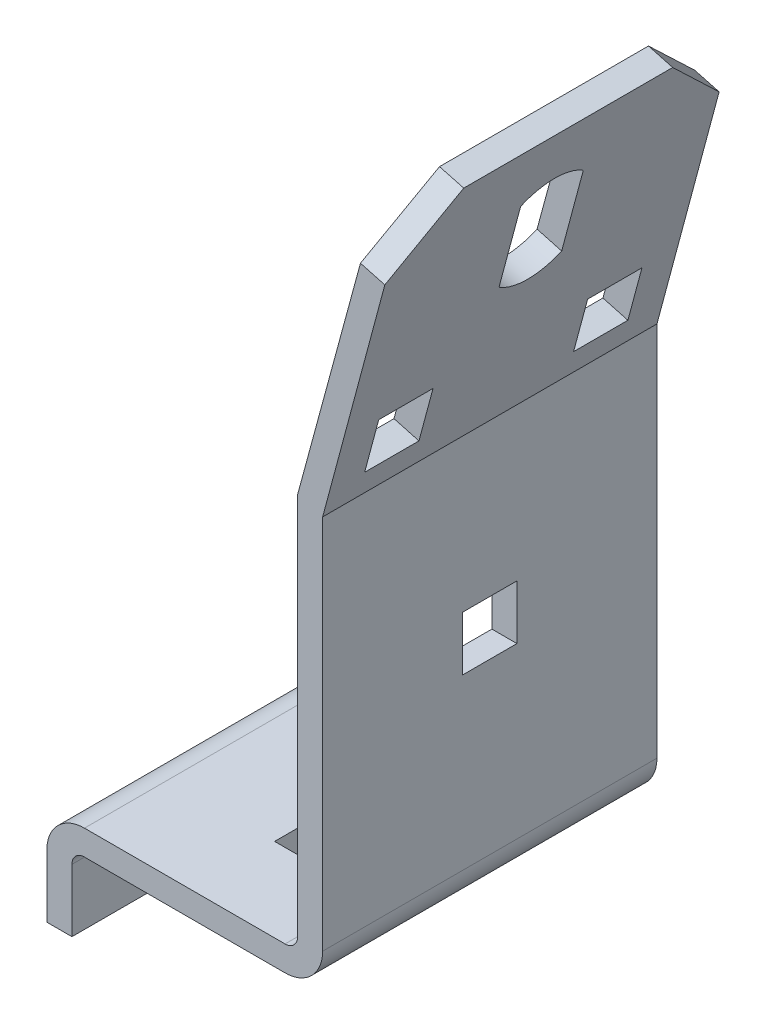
from build123d import *

# Parameters (mm, degrees)
CORPS_DEPTH                         = 80
CHANFREIN1_SIZE                     = 15
CHANFREIN2_SIZE                     = 15
TROU_OUBLON_DEPTH                   = 50
ESQUISSE3_W                         = 13
ESQUISSE3_H                         = 13
TROU_DE_FIXATION_DEPTH              = 50
ESQUISSE4_W                         = 13
ESQUISSE4_H                         = 13
TROU_DE_FIXATION_DES_RENFORTS_DEPTH = 10
ESQUISSE5_W                         = 13
ESQUISSE5_H                         = 40
TROU_DE_FIXATION_SUR_CHASSIS_DEPTH  = 10


with BuildPart() as part:
    # Esquisse1 → corps (new body)
    with BuildSketch(Plane.XY):
        with BuildLine():
            Line((0, 0), (6, 0))
            Line((6, 0), (6, 12))
            Line((6, 12), (6, 15))
            ThreePointArc((6, 15), (6.878679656, 17.121320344), (9, 18))
            Line((9, 18), (57, 18))
            ThreePointArc((57, 18), (63.363961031, 20.636038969), (66, 27))
            Line((66, 27), (66, 30))
            Line((66, 30), (66, 117))
            Line((66, 117), (84.76438077, 187.029622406))
            Line((84.76438077, 187.029622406), (78.968825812, 188.582536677))
            Line((78.968825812, 188.582536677), (60, 118.608015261))
            Line((60, 118.608015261), (60, 30))
            Line((60, 30), (60, 27))
            ThreePointArc((60, 27), (59.121320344, 24.878679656), (57, 24))
            Line((57, 24), (48, 24))
            Line((48, 24), (13.494646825, 24))
            Line((13.494646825, 24), (12, 24))
            Line((12, 24), (9, 24))
            ThreePointArc((9, 24), (2.636038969, 21.363961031), (0, 15))
            Line((0, 15), (0, 12))
            Line((0, 12), (0, 0))
        make_face()
    extrude(amount=-CORPS_DEPTH)

    # Chanfrein1
    chanfrein1_edges = [part.edges().sort_by_distance(p)[0] for p in [
        (81.866603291, 187.806079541, 0),
    ]]
    chamfer(chanfrein1_edges, length=CHANFREIN1_SIZE)

    # Chanfrein2
    chanfrein2_edges = [part.edges().sort_by_distance(p)[0] for p in [
        (81.866603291, 187.806079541, -80),
    ]]
    chamfer(chanfrein2_edges, length=CHANFREIN2_SIZE)

    # Esquisse2 → trou oublon (cut)
    with BuildSketch(Plane(origin=(25.941214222, -7.03219349, 0), x_dir=(0, 0, 1), z_dir=(-0.9651658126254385, 0.2616389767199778, 0))):
        with BuildLine():
            Line((-32.5, 187.674740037), (-32.5, 167.674740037))
            ThreePointArc((-32.5, 167.674740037), (-40, 165.174740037), (-47.5, 167.674740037))
            Line((-47.5, 167.674740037), (-47.5, 187.674740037))
            ThreePointArc((-47.5, 187.674740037), (-40, 190.174740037), (-32.5, 187.674740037))
        make_face()
    extrude(amount=-TROU_OUBLON_DEPTH, mode=Mode.SUBTRACT)

    # Esquisse3 → trou de fixation (cut)
    with BuildSketch(Plane(origin=(25.941214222, -7.03219349, 0), x_dir=(0, 0, 1), z_dir=(-0.9651658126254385, 0.2616389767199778, 0))):
        with Locations((-15, 142.674740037)):
            Rectangle(ESQUISSE3_W, ESQUISSE3_H)
        with Locations((-65, 142.674740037)):
            Rectangle(ESQUISSE3_W, ESQUISSE3_H)
    extrude(amount=-TROU_DE_FIXATION_DEPTH, mode=Mode.SUBTRACT)

    # Esquisse4 → trou de fixation des renforts (cut)
    with BuildSketch(Plane.ZY.offset(-60)):
        with Locations((-40, 74)):
            Rectangle(ESQUISSE4_W, ESQUISSE4_H)
    extrude(amount=-TROU_DE_FIXATION_DES_RENFORTS_DEPTH, mode=Mode.SUBTRACT)

    # Esquisse5 → trou de fixation sur chassis (cut)
    with BuildSketch(Plane(origin=(0, 24, 0), x_dir=(-1, 0, 0), z_dir=(0, 1, 0))):
        with Locations((-41, -40)):
            Rectangle(ESQUISSE5_W, ESQUISSE5_H)
    extrude(amount=-TROU_DE_FIXATION_SUR_CHASSIS_DEPTH, mode=Mode.SUBTRACT)


solid = part.part
